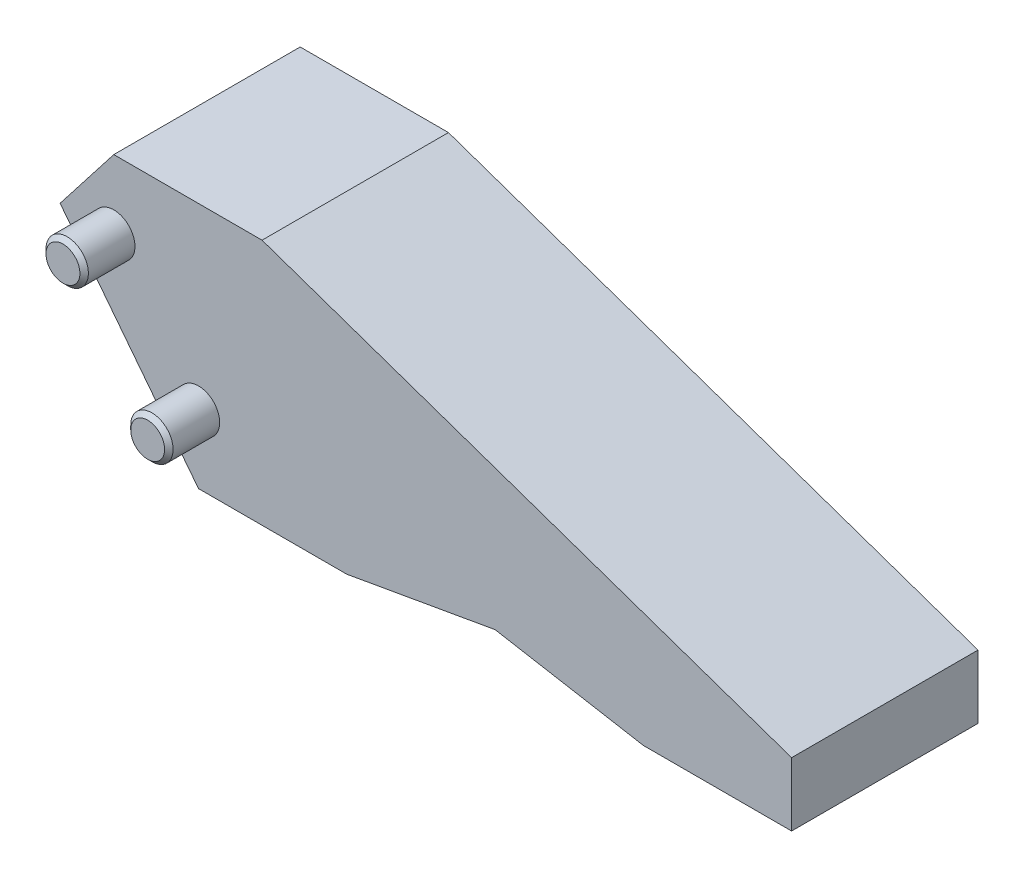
from build123d import *

# Parameters (mm, degrees)
ESQUISSE1_R          = 5
BASE_EXTRUSION_DEPTH = 22
ESQUISSE2_R          = 5
AXES_DEPTH           = 34
CHANFREIN1_SIZE      = 1


with BuildPart() as part:
    # Esquisse1 → Base-Extrusion (new, symmetric)
    with BuildSketch(Plane.XY):
        Polygon((0, 16.287511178), (35, 16.287511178), (160, -27), (160, -42), (125, -42), (90, -35.828555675), (55, -42), (20, -42), (-12.668949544, 0), align=None)
        Circle(ESQUISSE1_R, mode=Mode.SUBTRACT)
        with Locations((20, -26)):
            Circle(ESQUISSE1_R, mode=Mode.SUBTRACT)
    extrude(amount=BASE_EXTRUSION_DEPTH, both=True)

    # Esquisse2 → Axes (add, symmetric)
    with BuildSketch(Plane.XY):
        with Locations((20, -26)):
            Circle(ESQUISSE2_R)
        Circle(ESQUISSE2_R)
    extrude(amount=AXES_DEPTH, both=True)

    # Chanfrein1
    chanfrein1_edges = [part.edges().sort_by_distance(p)[0] for p in [
        (15, -26, -34),
        (-5, 0, -34),
        (-5, 0, 34),
        (15, -26, 34),
    ]]
    chamfer(chanfrein1_edges, length=CHANFREIN1_SIZE)


solid = part.part
